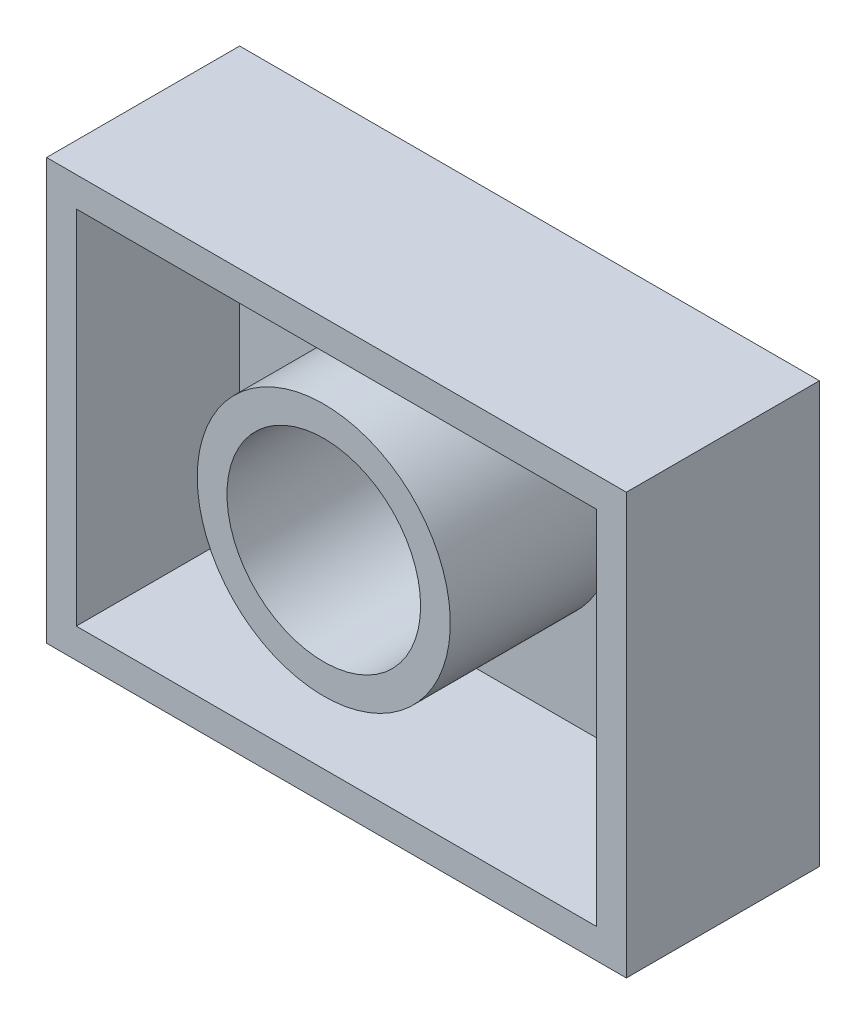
ISO-10303-21;
HEADER;
FILE_DESCRIPTION(('STEP AP214'),'2;1');
FILE_NAME('part.step','',(''),(''),'','','');
FILE_SCHEMA(('AUTOMOTIVE_DESIGN { 1 0 10303 214 1 1 1 1 }'));
ENDSEC;
DATA;
#1=APPLICATION_CONTEXT('core data for automotive mechanical design processes');
#2=APPLICATION_PROTOCOL_DEFINITION('international standard','automotive_design',2000,#1);
#3=PRODUCT_CONTEXT('',#1,'mechanical');
#4=PRODUCT('Part','Part','',(#3));
#5=PRODUCT_RELATED_PRODUCT_CATEGORY('part','',(#4));
#6=PRODUCT_DEFINITION_FORMATION('','',#4);
#7=PRODUCT_DEFINITION_CONTEXT('part definition',#1,'design');
#8=PRODUCT_DEFINITION('design','',#6,#7);
#9=PRODUCT_DEFINITION_SHAPE('','',#8);
#10=(LENGTH_UNIT() NAMED_UNIT(*) SI_UNIT(.MILLI.,.METRE.));
#11=(NAMED_UNIT(*) PLANE_ANGLE_UNIT() SI_UNIT($,.RADIAN.));
#12=(NAMED_UNIT(*) SI_UNIT($,.STERADIAN.) SOLID_ANGLE_UNIT());
#13=UNCERTAINTY_MEASURE_WITH_UNIT(LENGTH_MEASURE(1.E-05),#10,'distance_accuracy_value','');
#14=(GEOMETRIC_REPRESENTATION_CONTEXT(3) GLOBAL_UNCERTAINTY_ASSIGNED_CONTEXT((#13)) GLOBAL_UNIT_ASSIGNED_CONTEXT((#10,
#11,#12)) REPRESENTATION_CONTEXT('',''));
#15=CARTESIAN_POINT('',(0.,0.,0.));
#16=DIRECTION('',(0.,0.,1.));
#17=DIRECTION('',(1.,0.,0.));
#18=AXIS2_PLACEMENT_3D('',#15,#16,#17);
#19=CARTESIAN_POINT('',(0.,35.9779903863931,16.51));
#20=DIRECTION('',(0.,0.,-1.));
#21=DIRECTION('',(-1.,0.,0.));
#22=AXIS2_PLACEMENT_3D('',#19,#20,#21);
#23=PLANE('',#22);
#24=DIRECTION('',(0.,-1.,0.));
#25=VECTOR('',#24,1.);
#26=CARTESIAN_POINT('',(0.,0.,16.51));
#27=LINE('',#26,#25);
#28=CARTESIAN_POINT('',(0.,35.9779903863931,16.51));
#29=VERTEX_POINT('',#28);
#30=CARTESIAN_POINT('',(0.,0.,16.51));
#31=VERTEX_POINT('',#30);
#32=EDGE_CURVE('E154',#29,#31,#27,.T.);
#33=ORIENTED_EDGE('',*,*,#32,.T.);
#34=DIRECTION('',(1.,0.,0.));
#35=VECTOR('',#34,1.);
#36=CARTESIAN_POINT('',(0.,0.,16.51));
#37=LINE('',#36,#35);
#38=CARTESIAN_POINT('',(49.5809761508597,0.,16.51));
#39=VERTEX_POINT('',#38);
#40=EDGE_CURVE('E156',#31,#39,#37,.T.);
#41=ORIENTED_EDGE('',*,*,#40,.T.);
#42=DIRECTION('',(0.,1.,0.));
#43=VECTOR('',#42,1.);
#44=CARTESIAN_POINT('',(49.5809761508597,0.,16.51));
#45=LINE('',#44,#43);
#46=CARTESIAN_POINT('',(49.5809761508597,35.9779903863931,16.51));
#47=VERTEX_POINT('',#46);
#48=EDGE_CURVE('E158',#39,#47,#45,.T.);
#49=ORIENTED_EDGE('',*,*,#48,.T.);
#50=DIRECTION('',(-1.,0.,0.));
#51=VECTOR('',#50,1.);
#52=CARTESIAN_POINT('',(0.,35.9779903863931,16.51));
#53=LINE('',#52,#51);
#54=EDGE_CURVE('E56',#47,#29,#53,.T.);
#55=ORIENTED_EDGE('',*,*,#54,.T.);
#56=EDGE_LOOP('',(#33,#41,#49,#55));
#57=FACE_BOUND('',#56,.T.);
#58=DIRECTION('',(0.,-1.,0.));
#59=VECTOR('',#58,1.);
#60=CARTESIAN_POINT('',(2.54,35.9779903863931,16.51));
#61=LINE('',#60,#59);
#62=CARTESIAN_POINT('',(2.54,33.4379903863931,16.51));
#63=VERTEX_POINT('',#62);
#64=CARTESIAN_POINT('',(2.54,2.54,16.51));
#65=VERTEX_POINT('',#64);
#66=EDGE_CURVE('E122',#63,#65,#61,.T.);
#67=ORIENTED_EDGE('',*,*,#66,.F.);
#68=DIRECTION('',(-1.,0.,0.));
#69=VECTOR('',#68,1.);
#70=CARTESIAN_POINT('',(0.,33.4379903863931,16.51));
#71=LINE('',#70,#69);
#72=CARTESIAN_POINT('',(47.0409761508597,33.4379903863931,16.51));
#73=VERTEX_POINT('',#72);
#74=EDGE_CURVE('E135',#73,#63,#71,.T.);
#75=ORIENTED_EDGE('',*,*,#74,.F.);
#76=DIRECTION('',(0.,1.,0.));
#77=VECTOR('',#76,1.);
#78=CARTESIAN_POINT('',(47.0409761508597,35.9779903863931,16.51));
#79=LINE('',#78,#77);
#80=CARTESIAN_POINT('',(47.0409761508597,2.54,16.51));
#81=VERTEX_POINT('',#80);
#82=EDGE_CURVE('E133',#81,#73,#79,.T.);
#83=ORIENTED_EDGE('',*,*,#82,.F.);
#84=DIRECTION('',(1.,0.,0.));
#85=VECTOR('',#84,1.);
#86=CARTESIAN_POINT('',(0.,2.54,16.51));
#87=LINE('',#86,#85);
#88=EDGE_CURVE('E114',#65,#81,#87,.T.);
#89=ORIENTED_EDGE('',*,*,#88,.F.);
#90=EDGE_LOOP('',(#67,#75,#83,#89));
#91=FACE_BOUND('',#90,.T.);
#92=ADVANCED_FACE('F33',(#57,#91),#23,.F.);
#93=CARTESIAN_POINT('',(0.,0.,16.51));
#94=DIRECTION('',(1.,0.,0.));
#95=DIRECTION('',(0.,0.,-1.));
#96=AXIS2_PLACEMENT_3D('',#93,#94,#95);
#97=PLANE('',#96);
#98=DIRECTION('',(0.,-1.,0.));
#99=VECTOR('',#98,1.);
#100=CARTESIAN_POINT('',(0.,0.,0.));
#101=LINE('',#100,#99);
#102=CARTESIAN_POINT('',(0.,35.9779903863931,0.));
#103=VERTEX_POINT('',#102);
#104=CARTESIAN_POINT('',(0.,0.,0.));
#105=VERTEX_POINT('',#104);
#106=EDGE_CURVE('E145',#103,#105,#101,.T.);
#107=ORIENTED_EDGE('',*,*,#106,.T.);
#108=DIRECTION('',(0.,0.,-1.));
#109=VECTOR('',#108,1.);
#110=CARTESIAN_POINT('',(0.,0.,16.51));
#111=LINE('',#110,#109);
#112=EDGE_CURVE('E11',#31,#105,#111,.T.);
#113=ORIENTED_EDGE('',*,*,#112,.F.);
#114=ORIENTED_EDGE('',*,*,#32,.F.);
#115=DIRECTION('',(0.,0.,-1.));
#116=VECTOR('',#115,1.);
#117=CARTESIAN_POINT('',(0.,35.9779903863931,16.51));
#118=LINE('',#117,#116);
#119=EDGE_CURVE('E161',#29,#103,#118,.T.);
#120=ORIENTED_EDGE('',*,*,#119,.T.);
#121=EDGE_LOOP('',(#107,#113,#114,#120));
#122=FACE_BOUND('',#121,.T.);
#123=ADVANCED_FACE('F35',(#122),#97,.F.);
#124=CARTESIAN_POINT('',(0.,0.,16.51));
#125=DIRECTION('',(0.,1.,0.));
#126=DIRECTION('',(0.,0.,1.));
#127=AXIS2_PLACEMENT_3D('',#124,#125,#126);
#128=PLANE('',#127);
#129=DIRECTION('',(1.,0.,0.));
#130=VECTOR('',#129,1.);
#131=CARTESIAN_POINT('',(0.,0.,0.));
#132=LINE('',#131,#130);
#133=CARTESIAN_POINT('',(49.5809761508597,0.,0.));
#134=VERTEX_POINT('',#133);
#135=EDGE_CURVE('E148',#105,#134,#132,.T.);
#136=ORIENTED_EDGE('',*,*,#135,.T.);
#137=DIRECTION('',(0.,0.,-1.));
#138=VECTOR('',#137,1.);
#139=CARTESIAN_POINT('',(49.5809761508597,0.,16.51));
#140=LINE('',#139,#138);
#141=EDGE_CURVE('E41',#39,#134,#140,.T.);
#142=ORIENTED_EDGE('',*,*,#141,.F.);
#143=ORIENTED_EDGE('',*,*,#40,.F.);
#144=ORIENTED_EDGE('',*,*,#112,.T.);
#145=EDGE_LOOP('',(#136,#142,#143,#144));
#146=FACE_BOUND('',#145,.T.);
#147=ADVANCED_FACE('F184',(#146),#128,.F.);
#148=CARTESIAN_POINT('',(49.5809761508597,0.,16.51));
#149=DIRECTION('',(-1.,0.,0.));
#150=DIRECTION('',(0.,0.,1.));
#151=AXIS2_PLACEMENT_3D('',#148,#149,#150);
#152=PLANE('',#151);
#153=DIRECTION('',(0.,1.,0.));
#154=VECTOR('',#153,1.);
#155=CARTESIAN_POINT('',(49.5809761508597,0.,0.));
#156=LINE('',#155,#154);
#157=CARTESIAN_POINT('',(49.5809761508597,35.9779903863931,0.));
#158=VERTEX_POINT('',#157);
#159=EDGE_CURVE('E150',#134,#158,#156,.T.);
#160=ORIENTED_EDGE('',*,*,#159,.T.);
#161=DIRECTION('',(0.,0.,-1.));
#162=VECTOR('',#161,1.);
#163=CARTESIAN_POINT('',(49.5809761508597,35.9779903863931,16.51));
#164=LINE('',#163,#162);
#165=EDGE_CURVE('E164',#47,#158,#164,.T.);
#166=ORIENTED_EDGE('',*,*,#165,.F.);
#167=ORIENTED_EDGE('',*,*,#48,.F.);
#168=ORIENTED_EDGE('',*,*,#141,.T.);
#169=EDGE_LOOP('',(#160,#166,#167,#168));
#170=FACE_BOUND('',#169,.T.);
#171=ADVANCED_FACE('F171',(#170),#152,.F.);
#172=CARTESIAN_POINT('',(0.,35.9779903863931,16.51));
#173=DIRECTION('',(0.,-1.,0.));
#174=DIRECTION('',(0.,0.,-1.));
#175=AXIS2_PLACEMENT_3D('',#172,#173,#174);
#176=PLANE('',#175);
#177=DIRECTION('',(-1.,0.,0.));
#178=VECTOR('',#177,1.);
#179=CARTESIAN_POINT('',(0.,35.9779903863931,0.));
#180=LINE('',#179,#178);
#181=EDGE_CURVE('E152',#158,#103,#180,.T.);
#182=ORIENTED_EDGE('',*,*,#181,.T.);
#183=ORIENTED_EDGE('',*,*,#119,.F.);
#184=ORIENTED_EDGE('',*,*,#54,.F.);
#185=ORIENTED_EDGE('',*,*,#165,.T.);
#186=EDGE_LOOP('',(#182,#183,#184,#185));
#187=FACE_BOUND('',#186,.T.);
#188=ADVANCED_FACE('F179',(#187),#176,.F.);
#189=CARTESIAN_POINT('',(23.7056729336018,18.7511055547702,16.51));
#190=DIRECTION('',(0.,0.,-1.));
#191=DIRECTION('',(-1.,0.,0.));
#192=AXIS2_PLACEMENT_3D('',#189,#190,#191);
#193=CIRCLE('',#192,10.8202157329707);
#194=CARTESIAN_POINT('',(12.8854572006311,18.7511055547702,16.51));
#195=VERTEX_POINT('',#194);
#196=EDGE_CURVE('E130',#195,#195,#193,.F.);
#197=ORIENTED_EDGE('',*,*,#196,.T.);
#198=EDGE_LOOP('',(#197));
#199=FACE_BOUND('',#198,.T.);
#200=CARTESIAN_POINT('',(23.7056729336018,18.7511055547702,16.51));
#201=DIRECTION('',(0.,0.,1.));
#202=DIRECTION('',(1.,0.,0.));
#203=AXIS2_PLACEMENT_3D('',#200,#201,#202);
#204=CIRCLE('',#203,8.28021573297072);
#205=CARTESIAN_POINT('',(31.9858886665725,18.7511055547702,16.51));
#206=VERTEX_POINT('',#205);
#207=EDGE_CURVE('E139',#206,#206,#204,.T.);
#208=ORIENTED_EDGE('',*,*,#207,.F.);
#209=EDGE_LOOP('',(#208));
#210=FACE_BOUND('',#209,.T.);
#211=ADVANCED_FACE('F193',(#199,#210),#23,.F.);
#212=CARTESIAN_POINT('',(0.,35.9779903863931,0.));
#213=DIRECTION('',(0.,0.,-1.));
#214=DIRECTION('',(-1.,0.,0.));
#215=AXIS2_PLACEMENT_3D('',#212,#213,#214);
#216=PLANE('',#215);
#217=CARTESIAN_POINT('',(23.7056729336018,18.7511055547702,0.));
#218=DIRECTION('',(0.,0.,1.));
#219=DIRECTION('',(1.,0.,0.));
#220=AXIS2_PLACEMENT_3D('',#217,#218,#219);
#221=CIRCLE('',#220,8.28021573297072);
#222=CARTESIAN_POINT('',(31.9858886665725,18.7511055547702,0.));
#223=VERTEX_POINT('',#222);
#224=EDGE_CURVE('E142',#223,#223,#221,.T.);
#225=ORIENTED_EDGE('',*,*,#224,.T.);
#226=EDGE_LOOP('',(#225));
#227=FACE_BOUND('',#226,.T.);
#228=ORIENTED_EDGE('',*,*,#106,.F.);
#229=ORIENTED_EDGE('',*,*,#181,.F.);
#230=ORIENTED_EDGE('',*,*,#159,.F.);
#231=ORIENTED_EDGE('',*,*,#135,.F.);
#232=EDGE_LOOP('',(#228,#229,#230,#231));
#233=FACE_BOUND('',#232,.T.);
#234=ADVANCED_FACE('F177',(#227,#233),#216,.T.);
#235=CARTESIAN_POINT('',(23.7056729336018,18.7511055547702,0.));
#236=DIRECTION('',(0.,0.,1.));
#237=DIRECTION('',(1.,0.,0.));
#238=AXIS2_PLACEMENT_3D('',#235,#236,#237);
#239=CYLINDRICAL_SURFACE('',#238,8.28021573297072);
#240=ORIENTED_EDGE('',*,*,#224,.F.);
#241=EDGE_LOOP('',(#240));
#242=FACE_BOUND('',#241,.T.);
#243=ORIENTED_EDGE('',*,*,#207,.T.);
#244=EDGE_LOOP('',(#243));
#245=FACE_BOUND('',#244,.T.);
#246=ADVANCED_FACE('F204',(#242,#245),#239,.F.);
#247=CARTESIAN_POINT('',(2.54,0.,16.51));
#248=DIRECTION('',(1.,0.,0.));
#249=DIRECTION('',(0.,0.,-1.));
#250=AXIS2_PLACEMENT_3D('',#247,#248,#249);
#251=PLANE('',#250);
#252=DIRECTION('',(0.,-1.,0.));
#253=VECTOR('',#252,1.);
#254=CARTESIAN_POINT('',(2.54,35.9779903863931,2.54));
#255=LINE('',#254,#253);
#256=CARTESIAN_POINT('',(2.54,33.4379903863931,2.54));
#257=VERTEX_POINT('',#256);
#258=CARTESIAN_POINT('',(2.54,2.54,2.54));
#259=VERTEX_POINT('',#258);
#260=EDGE_CURVE('E105',#257,#259,#255,.T.);
#261=ORIENTED_EDGE('',*,*,#260,.F.);
#262=DIRECTION('',(0.,0.,-1.));
#263=VECTOR('',#262,1.);
#264=CARTESIAN_POINT('',(2.54,33.4379903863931,16.51));
#265=LINE('',#264,#263);
#266=EDGE_CURVE('E125',#63,#257,#265,.T.);
#267=ORIENTED_EDGE('',*,*,#266,.F.);
#268=ORIENTED_EDGE('',*,*,#66,.T.);
#269=DIRECTION('',(0.,0.,-1.));
#270=VECTOR('',#269,1.);
#271=CARTESIAN_POINT('',(2.54,2.54,16.51));
#272=LINE('',#271,#270);
#273=EDGE_CURVE('E117',#65,#259,#272,.T.);
#274=ORIENTED_EDGE('',*,*,#273,.T.);
#275=EDGE_LOOP('',(#261,#267,#268,#274));
#276=FACE_BOUND('',#275,.T.);
#277=ADVANCED_FACE('F211',(#276),#251,.T.);
#278=CARTESIAN_POINT('',(0.,2.54,16.51));
#279=DIRECTION('',(0.,1.,0.));
#280=DIRECTION('',(0.,0.,1.));
#281=AXIS2_PLACEMENT_3D('',#278,#279,#280);
#282=PLANE('',#281);
#283=DIRECTION('',(1.,0.,0.));
#284=VECTOR('',#283,1.);
#285=CARTESIAN_POINT('',(0.,2.54,2.54));
#286=LINE('',#285,#284);
#287=CARTESIAN_POINT('',(47.0409761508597,2.54,2.54));
#288=VERTEX_POINT('',#287);
#289=EDGE_CURVE('E99',#259,#288,#286,.T.);
#290=ORIENTED_EDGE('',*,*,#289,.F.);
#291=ORIENTED_EDGE('',*,*,#273,.F.);
#292=ORIENTED_EDGE('',*,*,#88,.T.);
#293=DIRECTION('',(0.,0.,-1.));
#294=VECTOR('',#293,1.);
#295=CARTESIAN_POINT('',(47.0409761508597,2.54,16.51));
#296=LINE('',#295,#294);
#297=EDGE_CURVE('E111',#81,#288,#296,.T.);
#298=ORIENTED_EDGE('',*,*,#297,.T.);
#299=EDGE_LOOP('',(#290,#291,#292,#298));
#300=FACE_BOUND('',#299,.T.);
#301=ADVANCED_FACE('F112',(#300),#282,.T.);
#302=CARTESIAN_POINT('',(47.0409761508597,0.,16.51));
#303=DIRECTION('',(-1.,0.,0.));
#304=DIRECTION('',(0.,0.,1.));
#305=AXIS2_PLACEMENT_3D('',#302,#303,#304);
#306=PLANE('',#305);
#307=DIRECTION('',(0.,1.,0.));
#308=VECTOR('',#307,1.);
#309=CARTESIAN_POINT('',(47.0409761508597,35.9779903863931,2.54));
#310=LINE('',#309,#308);
#311=CARTESIAN_POINT('',(47.0409761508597,33.4379903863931,2.54));
#312=VERTEX_POINT('',#311);
#313=EDGE_CURVE('E103',#288,#312,#310,.T.);
#314=ORIENTED_EDGE('',*,*,#313,.F.);
#315=ORIENTED_EDGE('',*,*,#297,.F.);
#316=ORIENTED_EDGE('',*,*,#82,.T.);
#317=DIRECTION('',(0.,0.,-1.));
#318=VECTOR('',#317,1.);
#319=CARTESIAN_POINT('',(47.0409761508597,33.4379903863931,16.51));
#320=LINE('',#319,#318);
#321=EDGE_CURVE('E48',#73,#312,#320,.T.);
#322=ORIENTED_EDGE('',*,*,#321,.T.);
#323=EDGE_LOOP('',(#314,#315,#316,#322));
#324=FACE_BOUND('',#323,.T.);
#325=ADVANCED_FACE('F119',(#324),#306,.T.);
#326=CARTESIAN_POINT('',(0.,33.4379903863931,16.51));
#327=DIRECTION('',(0.,-1.,0.));
#328=DIRECTION('',(0.,0.,-1.));
#329=AXIS2_PLACEMENT_3D('',#326,#327,#328);
#330=PLANE('',#329);
#331=DIRECTION('',(-1.,0.,0.));
#332=VECTOR('',#331,1.);
#333=CARTESIAN_POINT('',(0.,33.4379903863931,2.54));
#334=LINE('',#333,#332);
#335=EDGE_CURVE('E120',#312,#257,#334,.T.);
#336=ORIENTED_EDGE('',*,*,#335,.F.);
#337=ORIENTED_EDGE('',*,*,#321,.F.);
#338=ORIENTED_EDGE('',*,*,#74,.T.);
#339=ORIENTED_EDGE('',*,*,#266,.T.);
#340=EDGE_LOOP('',(#336,#337,#338,#339));
#341=FACE_BOUND('',#340,.T.);
#342=ADVANCED_FACE('F227',(#341),#330,.T.);
#343=CARTESIAN_POINT('',(0.,35.9779903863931,2.54));
#344=DIRECTION('',(0.,0.,-1.));
#345=DIRECTION('',(-1.,0.,0.));
#346=AXIS2_PLACEMENT_3D('',#343,#344,#345);
#347=PLANE('',#346);
#348=CARTESIAN_POINT('',(23.7056729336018,18.7511055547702,2.54));
#349=DIRECTION('',(0.,0.,-1.));
#350=DIRECTION('',(-1.,0.,0.));
#351=AXIS2_PLACEMENT_3D('',#348,#349,#350);
#352=CIRCLE('',#351,10.8202157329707);
#353=CARTESIAN_POINT('',(12.8854572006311,18.7511055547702,2.54));
#354=VERTEX_POINT('',#353);
#355=EDGE_CURVE('E127',#354,#354,#352,.F.);
#356=ORIENTED_EDGE('',*,*,#355,.F.);
#357=EDGE_LOOP('',(#356));
#358=FACE_BOUND('',#357,.T.);
#359=ORIENTED_EDGE('',*,*,#260,.T.);
#360=ORIENTED_EDGE('',*,*,#289,.T.);
#361=ORIENTED_EDGE('',*,*,#313,.T.);
#362=ORIENTED_EDGE('',*,*,#335,.T.);
#363=EDGE_LOOP('',(#359,#360,#361,#362));
#364=FACE_BOUND('',#363,.T.);
#365=ADVANCED_FACE('F101',(#358,#364),#347,.F.);
#366=CARTESIAN_POINT('',(23.7056729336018,18.7511055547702,0.));
#367=DIRECTION('',(0.,0.,1.));
#368=DIRECTION('',(1.,0.,0.));
#369=AXIS2_PLACEMENT_3D('',#366,#367,#368);
#370=CYLINDRICAL_SURFACE('',#369,10.8202157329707);
#371=ORIENTED_EDGE('',*,*,#355,.T.);
#372=EDGE_LOOP('',(#371));
#373=FACE_BOUND('',#372,.T.);
#374=ORIENTED_EDGE('',*,*,#196,.F.);
#375=EDGE_LOOP('',(#374));
#376=FACE_BOUND('',#375,.T.);
#377=ADVANCED_FACE('F221',(#373,#376),#370,.T.);
#378=CLOSED_SHELL('',(#92,#123,#147,#171,#188,#211,#234,#246,#277,#301,#325,#342,#365,#377));
#379=MANIFOLD_SOLID_BREP('B2',#378);
#380=ADVANCED_BREP_SHAPE_REPRESENTATION('',(#18,#379),#14);
#381=SHAPE_DEFINITION_REPRESENTATION(#9,#380);
ENDSEC;
END-ISO-10303-21;
